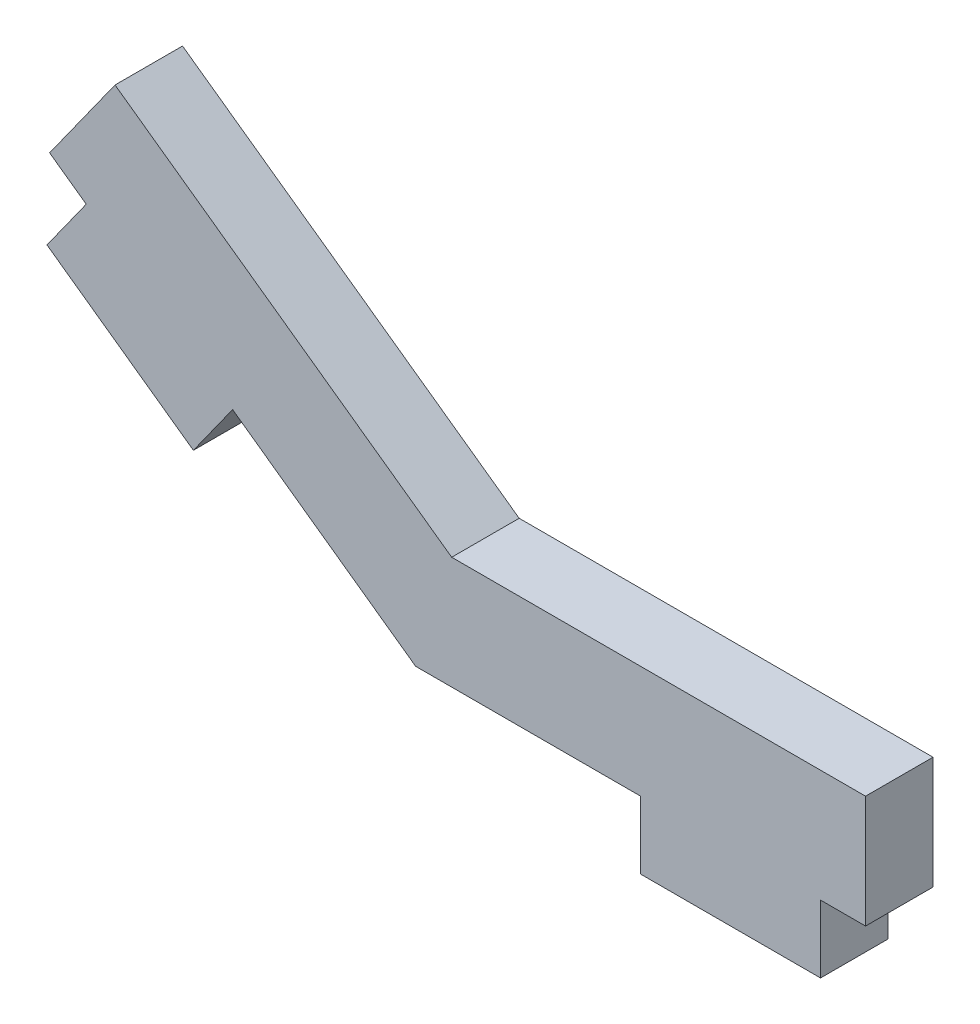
from build123d import *

# Parameters (mm, degrees)
EXTRUDE_1_DEPTH = 3
SKETCH_2_W      = 8
SKETCH_2_H      = 3
EXTRUDE_2_DEPTH = 3


with BuildPart() as part:
    # Sketch 1 → Extrude 1 (new body)
    with BuildSketch(Plane.XY):
        Polygon((0, 0), (20, 0), (20, 5), (1.603399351, 5), (-13.362363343, 15.698638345), (-16.270139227, 11.631103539), align=None)
    extrude(amount=EXTRUDE_1_DEPTH)

    # Sketch 2 → Extrude 2 (add)
    with BuildSketch(Plane.XY.offset(3)):
        with Locations((14, -1.5)):
            Rectangle(SKETCH_2_W, SKETCH_2_H)
        Polygon((-14.643125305, 10.467993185), (-8.135069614, 5.815551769), (-9.879735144, 3.375030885), (-16.387790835, 8.027472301), align=None)
    extrude(amount=-EXTRUDE_2_DEPTH)


solid = part.part
